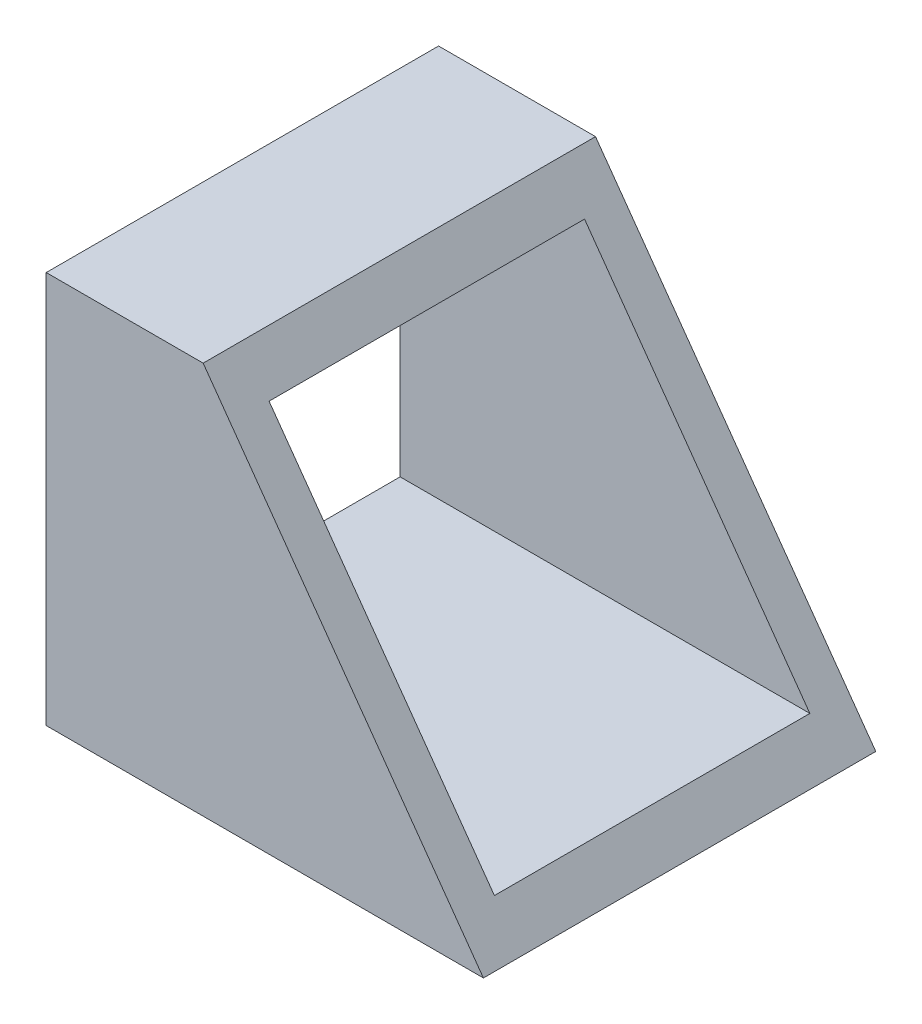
ISO-10303-21;
HEADER;
FILE_DESCRIPTION(('STEP AP214'),'2;1');
FILE_NAME('part.step','',(''),(''),'','','');
FILE_SCHEMA(('AUTOMOTIVE_DESIGN { 1 0 10303 214 1 1 1 1 }'));
ENDSEC;
DATA;
#1=APPLICATION_CONTEXT('core data for automotive mechanical design processes');
#2=APPLICATION_PROTOCOL_DEFINITION('international standard','automotive_design',2000,#1);
#3=PRODUCT_CONTEXT('',#1,'mechanical');
#4=PRODUCT('Part','Part','',(#3));
#5=PRODUCT_RELATED_PRODUCT_CATEGORY('part','',(#4));
#6=PRODUCT_DEFINITION_FORMATION('','',#4);
#7=PRODUCT_DEFINITION_CONTEXT('part definition',#1,'design');
#8=PRODUCT_DEFINITION('design','',#6,#7);
#9=PRODUCT_DEFINITION_SHAPE('','',#8);
#10=(LENGTH_UNIT() NAMED_UNIT(*) SI_UNIT(.MILLI.,.METRE.));
#11=(NAMED_UNIT(*) PLANE_ANGLE_UNIT() SI_UNIT($,.RADIAN.));
#12=(NAMED_UNIT(*) SI_UNIT($,.STERADIAN.) SOLID_ANGLE_UNIT());
#13=UNCERTAINTY_MEASURE_WITH_UNIT(LENGTH_MEASURE(1.E-05),#10,'distance_accuracy_value','');
#14=(GEOMETRIC_REPRESENTATION_CONTEXT(3) GLOBAL_UNCERTAINTY_ASSIGNED_CONTEXT((#13)) GLOBAL_UNIT_ASSIGNED_CONTEXT((#10,
#11,#12)) REPRESENTATION_CONTEXT('',''));
#15=CARTESIAN_POINT('',(0.,0.,0.));
#16=DIRECTION('',(0.,0.,1.));
#17=DIRECTION('',(1.,0.,0.));
#18=AXIS2_PLACEMENT_3D('',#15,#16,#17);
#19=CARTESIAN_POINT('',(884.7793591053,631.985256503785,0.));
#20=DIRECTION('',(-0.813733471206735,-0.581238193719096,0.));
#21=DIRECTION('',(0.581238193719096,-0.813733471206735,0.));
#22=AXIS2_PLACEMENT_3D('',#19,#20,#21);
#23=PLANE('',#22);
#24=DIRECTION('',(-0.581238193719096,0.813733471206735,0.));
#25=VECTOR('',#24,1.);
#26=CARTESIAN_POINT('',(657.114747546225,950.71571268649,1359.12466372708));
#27=LINE('',#26,#25);
#28=CARTESIAN_POINT('',(690.961809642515,903.329825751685,1359.12466372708));
#29=VERTEX_POINT('',#28);
#30=CARTESIAN_POINT('',(673.104666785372,928.329825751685,1359.12466372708));
#31=VERTEX_POINT('',#30);
#32=EDGE_CURVE('E150',#29,#31,#27,.T.);
#33=ORIENTED_EDGE('',*,*,#32,.F.);
#34=DIRECTION('',(0.,0.,1.));
#35=VECTOR('',#34,1.);
#36=CARTESIAN_POINT('',(690.961809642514,903.329825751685,1153.93260269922));
#37=LINE('',#36,#35);
#38=CARTESIAN_POINT('',(690.961809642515,903.329825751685,1334.12466372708));
#39=VERTEX_POINT('',#38);
#40=EDGE_CURVE('E155',#39,#29,#37,.T.);
#41=ORIENTED_EDGE('',*,*,#40,.F.);
#42=DIRECTION('',(0.581238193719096,-0.813733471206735,0.));
#43=VECTOR('',#42,1.);
#44=CARTESIAN_POINT('',(657.114747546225,950.71571268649,1334.12466372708));
#45=LINE('',#44,#43);
#46=CARTESIAN_POINT('',(673.104666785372,928.329825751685,1334.12466372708));
#47=VERTEX_POINT('',#46);
#48=EDGE_CURVE('E160',#47,#39,#45,.T.);
#49=ORIENTED_EDGE('',*,*,#48,.F.);
#50=DIRECTION('',(0.,0.,-1.));
#51=VECTOR('',#50,1.);
#52=CARTESIAN_POINT('',(673.104666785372,928.329825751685,1153.93260269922));
#53=LINE('',#52,#51);
#54=EDGE_CURVE('E158',#31,#47,#53,.T.);
#55=ORIENTED_EDGE('',*,*,#54,.F.);
#56=EDGE_LOOP('',(#33,#41,#49,#55));
#57=FACE_BOUND('',#56,.T.);
#58=DIRECTION('',(-0.581238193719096,0.813733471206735,0.));
#59=VECTOR('',#58,1.);
#60=CARTESIAN_POINT('',(657.114747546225,950.71571268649,1356.67466372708));
#61=LINE('',#60,#59);
#62=CARTESIAN_POINT('',(689.211809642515,905.779825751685,1356.67466372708));
#63=VERTEX_POINT('',#62);
#64=CARTESIAN_POINT('',(674.854666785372,925.879825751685,1356.67466372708));
#65=VERTEX_POINT('',#64);
#66=EDGE_CURVE('E61',#63,#65,#61,.T.);
#67=ORIENTED_EDGE('',*,*,#66,.T.);
#68=DIRECTION('',(0.,0.,-1.));
#69=VECTOR('',#68,1.);
#70=CARTESIAN_POINT('',(674.854666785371,925.879825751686,1153.93260269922));
#71=LINE('',#70,#69);
#72=CARTESIAN_POINT('',(674.854666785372,925.879825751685,1336.57466372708));
#73=VERTEX_POINT('',#72);
#74=EDGE_CURVE('E140',#65,#73,#71,.T.);
#75=ORIENTED_EDGE('',*,*,#74,.T.);
#76=DIRECTION('',(0.581238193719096,-0.813733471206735,0.));
#77=VECTOR('',#76,1.);
#78=CARTESIAN_POINT('',(657.114747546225,950.71571268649,1336.57466372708));
#79=LINE('',#78,#77);
#80=CARTESIAN_POINT('',(689.211809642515,905.779825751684,1336.57466372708));
#81=VERTEX_POINT('',#80);
#82=EDGE_CURVE('E111',#73,#81,#79,.T.);
#83=ORIENTED_EDGE('',*,*,#82,.T.);
#84=DIRECTION('',(0.,0.,1.));
#85=VECTOR('',#84,1.);
#86=CARTESIAN_POINT('',(689.211809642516,905.779825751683,1153.93260269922));
#87=LINE('',#86,#85);
#88=EDGE_CURVE('E143',#81,#63,#87,.T.);
#89=ORIENTED_EDGE('',*,*,#88,.T.);
#90=EDGE_LOOP('',(#67,#75,#83,#89));
#91=FACE_BOUND('',#90,.T.);
#92=ADVANCED_FACE('F39',(#57,#91),#23,.F.);
#93=CARTESIAN_POINT('',(647.114747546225,950.71571268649,1359.12466372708));
#94=DIRECTION('',(0.,0.,-1.));
#95=DIRECTION('',(-1.,0.,0.));
#96=AXIS2_PLACEMENT_3D('',#93,#94,#95);
#97=PLANE('',#96);
#98=ORIENTED_EDGE('',*,*,#32,.T.);
#99=DIRECTION('',(1.,0.,0.));
#100=VECTOR('',#99,1.);
#101=CARTESIAN_POINT('',(663.104666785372,928.329825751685,1359.12466372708));
#102=LINE('',#101,#100);
#103=CARTESIAN_POINT('',(663.104666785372,928.329825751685,1359.12466372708));
#104=VERTEX_POINT('',#103);
#105=EDGE_CURVE('E11',#104,#31,#102,.T.);
#106=ORIENTED_EDGE('',*,*,#105,.F.);
#107=DIRECTION('',(0.,-1.,0.));
#108=VECTOR('',#107,1.);
#109=CARTESIAN_POINT('',(663.104666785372,903.329825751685,1359.12466372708));
#110=LINE('',#109,#108);
#111=CARTESIAN_POINT('',(663.104666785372,903.329825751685,1359.12466372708));
#112=VERTEX_POINT('',#111);
#113=EDGE_CURVE('E127',#104,#112,#110,.T.);
#114=ORIENTED_EDGE('',*,*,#113,.T.);
#115=DIRECTION('',(1.,0.,0.));
#116=VECTOR('',#115,1.);
#117=CARTESIAN_POINT('',(680.961809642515,903.329825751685,1359.12466372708));
#118=LINE('',#117,#116);
#119=EDGE_CURVE('E154',#112,#29,#118,.T.);
#120=ORIENTED_EDGE('',*,*,#119,.T.);
#121=EDGE_LOOP('',(#98,#106,#114,#120));
#122=FACE_BOUND('',#121,.T.);
#123=ADVANCED_FACE('F41',(#122),#97,.F.);
#124=CARTESIAN_POINT('',(663.104666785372,928.329825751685,1153.93260269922));
#125=DIRECTION('',(0.,-1.,0.));
#126=DIRECTION('',(0.,0.,-1.));
#127=AXIS2_PLACEMENT_3D('',#124,#125,#126);
#128=PLANE('',#127);
#129=ORIENTED_EDGE('',*,*,#54,.T.);
#130=DIRECTION('',(1.,0.,0.));
#131=VECTOR('',#130,1.);
#132=CARTESIAN_POINT('',(663.104666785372,928.329825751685,1334.12466372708));
#133=LINE('',#132,#131);
#134=CARTESIAN_POINT('',(663.104666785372,928.329825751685,1334.12466372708));
#135=VERTEX_POINT('',#134);
#136=EDGE_CURVE('E47',#135,#47,#133,.T.);
#137=ORIENTED_EDGE('',*,*,#136,.F.);
#138=DIRECTION('',(0.,0.,-1.));
#139=VECTOR('',#138,1.);
#140=CARTESIAN_POINT('',(663.104666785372,928.329825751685,1153.93260269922));
#141=LINE('',#140,#139);
#142=EDGE_CURVE('E151',#104,#135,#141,.T.);
#143=ORIENTED_EDGE('',*,*,#142,.F.);
#144=ORIENTED_EDGE('',*,*,#105,.T.);
#145=EDGE_LOOP('',(#129,#137,#143,#144));
#146=FACE_BOUND('',#145,.T.);
#147=ADVANCED_FACE('F183',(#146),#128,.F.);
#148=CARTESIAN_POINT('',(647.114747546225,950.71571268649,1334.12466372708));
#149=DIRECTION('',(0.,0.,1.));
#150=DIRECTION('',(1.,0.,0.));
#151=AXIS2_PLACEMENT_3D('',#148,#149,#150);
#152=PLANE('',#151);
#153=ORIENTED_EDGE('',*,*,#48,.T.);
#154=DIRECTION('',(1.,0.,0.));
#155=VECTOR('',#154,1.);
#156=CARTESIAN_POINT('',(680.961809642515,903.329825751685,1334.12466372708));
#157=LINE('',#156,#155);
#158=CARTESIAN_POINT('',(663.104666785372,903.329825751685,1334.12466372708));
#159=VERTEX_POINT('',#158);
#160=EDGE_CURVE('E165',#159,#39,#157,.T.);
#161=ORIENTED_EDGE('',*,*,#160,.F.);
#162=DIRECTION('',(0.,1.,0.));
#163=VECTOR('',#162,1.);
#164=CARTESIAN_POINT('',(663.104666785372,903.329825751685,1334.12466372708));
#165=LINE('',#164,#163);
#166=EDGE_CURVE('E131',#159,#135,#165,.T.);
#167=ORIENTED_EDGE('',*,*,#166,.T.);
#168=ORIENTED_EDGE('',*,*,#136,.T.);
#169=EDGE_LOOP('',(#153,#161,#167,#168));
#170=FACE_BOUND('',#169,.T.);
#171=ADVANCED_FACE('F170',(#170),#152,.F.);
#172=CARTESIAN_POINT('',(680.961809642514,903.329825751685,1153.93260269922));
#173=DIRECTION('',(0.,1.,0.));
#174=DIRECTION('',(0.,0.,1.));
#175=AXIS2_PLACEMENT_3D('',#172,#173,#174);
#176=PLANE('',#175);
#177=ORIENTED_EDGE('',*,*,#40,.T.);
#178=ORIENTED_EDGE('',*,*,#119,.F.);
#179=DIRECTION('',(0.,0.,1.));
#180=VECTOR('',#179,1.);
#181=CARTESIAN_POINT('',(663.104666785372,903.329825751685,1303.40207348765));
#182=LINE('',#181,#180);
#183=EDGE_CURVE('E134',#159,#112,#182,.T.);
#184=ORIENTED_EDGE('',*,*,#183,.F.);
#185=ORIENTED_EDGE('',*,*,#160,.T.);
#186=EDGE_LOOP('',(#177,#178,#184,#185));
#187=FACE_BOUND('',#186,.T.);
#188=ADVANCED_FACE('F178',(#187),#176,.F.);
#189=CARTESIAN_POINT('',(647.114747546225,950.71571268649,1356.67466372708));
#190=DIRECTION('',(0.,0.,-1.));
#191=DIRECTION('',(-1.,0.,0.));
#192=AXIS2_PLACEMENT_3D('',#189,#190,#191);
#193=PLANE('',#192);
#194=ORIENTED_EDGE('',*,*,#66,.F.);
#195=DIRECTION('',(1.,0.,0.));
#196=VECTOR('',#195,1.);
#197=CARTESIAN_POINT('',(679.211809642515,905.779825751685,1356.67466372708));
#198=LINE('',#197,#196);
#199=CARTESIAN_POINT('',(663.104666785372,905.779825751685,1356.67466372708));
#200=VERTEX_POINT('',#199);
#201=EDGE_CURVE('E146',#200,#63,#198,.T.);
#202=ORIENTED_EDGE('',*,*,#201,.F.);
#203=DIRECTION('',(0.,1.,0.));
#204=VECTOR('',#203,1.);
#205=CARTESIAN_POINT('',(663.104666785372,925.879825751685,1356.67466372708));
#206=LINE('',#205,#204);
#207=CARTESIAN_POINT('',(663.104666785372,925.879825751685,1356.67466372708));
#208=VERTEX_POINT('',#207);
#209=EDGE_CURVE('E120',#200,#208,#206,.T.);
#210=ORIENTED_EDGE('',*,*,#209,.T.);
#211=DIRECTION('',(1.,0.,0.));
#212=VECTOR('',#211,1.);
#213=CARTESIAN_POINT('',(664.854666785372,925.879825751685,1356.67466372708));
#214=LINE('',#213,#212);
#215=EDGE_CURVE('E54',#208,#65,#214,.T.);
#216=ORIENTED_EDGE('',*,*,#215,.T.);
#217=EDGE_LOOP('',(#194,#202,#210,#216));
#218=FACE_BOUND('',#217,.T.);
#219=ADVANCED_FACE('F196',(#218),#193,.T.);
#220=CARTESIAN_POINT('',(664.854666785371,925.879825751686,1153.93260269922));
#221=DIRECTION('',(0.,-1.,0.));
#222=DIRECTION('',(0.,0.,-1.));
#223=AXIS2_PLACEMENT_3D('',#220,#221,#222);
#224=PLANE('',#223);
#225=ORIENTED_EDGE('',*,*,#74,.F.);
#226=ORIENTED_EDGE('',*,*,#215,.F.);
#227=DIRECTION('',(0.,0.,-1.));
#228=VECTOR('',#227,1.);
#229=CARTESIAN_POINT('',(663.104666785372,925.879825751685,1336.57466372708));
#230=LINE('',#229,#228);
#231=CARTESIAN_POINT('',(663.104666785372,925.879825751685,1336.57466372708));
#232=VERTEX_POINT('',#231);
#233=EDGE_CURVE('E116',#208,#232,#230,.T.);
#234=ORIENTED_EDGE('',*,*,#233,.T.);
#235=DIRECTION('',(1.,0.,0.));
#236=VECTOR('',#235,1.);
#237=CARTESIAN_POINT('',(664.854666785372,925.879825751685,1336.57466372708));
#238=LINE('',#237,#236);
#239=EDGE_CURVE('E105',#232,#73,#238,.T.);
#240=ORIENTED_EDGE('',*,*,#239,.T.);
#241=EDGE_LOOP('',(#225,#226,#234,#240));
#242=FACE_BOUND('',#241,.T.);
#243=ADVANCED_FACE('F117',(#242),#224,.T.);
#244=CARTESIAN_POINT('',(647.114747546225,950.71571268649,1336.57466372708));
#245=DIRECTION('',(0.,0.,1.));
#246=DIRECTION('',(1.,0.,0.));
#247=AXIS2_PLACEMENT_3D('',#244,#245,#246);
#248=PLANE('',#247);
#249=ORIENTED_EDGE('',*,*,#82,.F.);
#250=ORIENTED_EDGE('',*,*,#239,.F.);
#251=DIRECTION('',(0.,-1.,0.));
#252=VECTOR('',#251,1.);
#253=CARTESIAN_POINT('',(663.104666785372,925.879825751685,1336.57466372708));
#254=LINE('',#253,#252);
#255=CARTESIAN_POINT('',(663.104666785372,905.779825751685,1336.57466372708));
#256=VERTEX_POINT('',#255);
#257=EDGE_CURVE('E108',#232,#256,#254,.T.);
#258=ORIENTED_EDGE('',*,*,#257,.T.);
#259=DIRECTION('',(1.,0.,0.));
#260=VECTOR('',#259,1.);
#261=CARTESIAN_POINT('',(679.211809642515,905.779825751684,1336.57466372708));
#262=LINE('',#261,#260);
#263=EDGE_CURVE('E113',#256,#81,#262,.T.);
#264=ORIENTED_EDGE('',*,*,#263,.T.);
#265=EDGE_LOOP('',(#249,#250,#258,#264));
#266=FACE_BOUND('',#265,.T.);
#267=ADVANCED_FACE('F106',(#266),#248,.T.);
#268=CARTESIAN_POINT('',(679.211809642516,905.779825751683,1153.93260269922));
#269=DIRECTION('',(0.,1.,0.));
#270=DIRECTION('',(0.,0.,1.));
#271=AXIS2_PLACEMENT_3D('',#268,#269,#270);
#272=PLANE('',#271);
#273=ORIENTED_EDGE('',*,*,#88,.F.);
#274=ORIENTED_EDGE('',*,*,#263,.F.);
#275=DIRECTION('',(0.,0.,1.));
#276=VECTOR('',#275,1.);
#277=CARTESIAN_POINT('',(663.104666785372,905.779825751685,1336.57466372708));
#278=LINE('',#277,#276);
#279=EDGE_CURVE('E125',#256,#200,#278,.T.);
#280=ORIENTED_EDGE('',*,*,#279,.T.);
#281=ORIENTED_EDGE('',*,*,#201,.T.);
#282=EDGE_LOOP('',(#273,#274,#280,#281));
#283=FACE_BOUND('',#282,.T.);
#284=ADVANCED_FACE('F208',(#283),#272,.T.);
#285=CARTESIAN_POINT('',(663.104666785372,903.329825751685,1303.40207348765));
#286=DIRECTION('',(-1.,0.,0.));
#287=DIRECTION('',(0.,0.,1.));
#288=AXIS2_PLACEMENT_3D('',#285,#286,#287);
#289=PLANE('',#288);
#290=ORIENTED_EDGE('',*,*,#209,.F.);
#291=ORIENTED_EDGE('',*,*,#279,.F.);
#292=ORIENTED_EDGE('',*,*,#257,.F.);
#293=ORIENTED_EDGE('',*,*,#233,.F.);
#294=EDGE_LOOP('',(#290,#291,#292,#293));
#295=FACE_BOUND('',#294,.T.);
#296=ORIENTED_EDGE('',*,*,#166,.F.);
#297=ORIENTED_EDGE('',*,*,#183,.T.);
#298=ORIENTED_EDGE('',*,*,#113,.F.);
#299=ORIENTED_EDGE('',*,*,#142,.T.);
#300=EDGE_LOOP('',(#296,#297,#298,#299));
#301=FACE_BOUND('',#300,.T.);
#302=ADVANCED_FACE('F122',(#295,#301),#289,.T.);
#303=CLOSED_SHELL('',(#92,#123,#147,#171,#188,#219,#243,#267,#284,#302));
#304=MANIFOLD_SOLID_BREP('B2',#303);
#305=ADVANCED_BREP_SHAPE_REPRESENTATION('',(#18,#304),#14);
#306=SHAPE_DEFINITION_REPRESENTATION(#9,#305);
ENDSEC;
END-ISO-10303-21;
